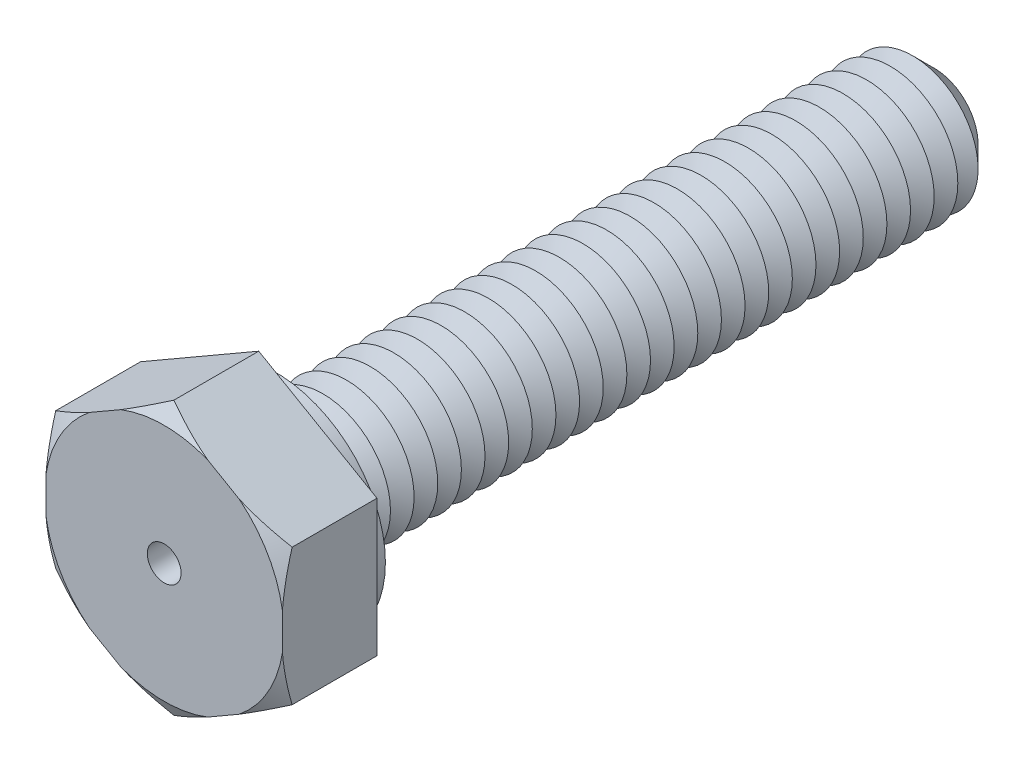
from build123d import *

# Parameters (mm, degrees)
BOSS_EXTRUDE1_DEPTH = 2.8
SKETCH3_R           = 2
BOSS_EXTRUDE2_DEPTH = 20
SKETCH4_R           = 3.25
BOSS_EXTRUDE3_DEPTH = 0.5
CHAMFER1_SIZE       = 0.7
LPATTERN1_COUNT     = 27
LPATTERN1_PITCH     = 0.7
SKETCH8_R           = 0.5
CUT_EXTRUDE1_DEPTH  = 22.8


with BuildPart() as part:
    # Sketch2 → Boss-Extrude1 (new body)
    with BuildSketch(Plane.XY):
        Polygon((0, 4.041451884), (-3.5, 2.020725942), (-3.5, -2.020725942), (0, -4.041451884), (3.5, -2.020725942), (3.5, 2.020725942), align=None)
    extrude(amount=BOSS_EXTRUDE1_DEPTH)

    # Sketch3 → Boss-Extrude2 (add)
    with BuildSketch(Plane(origin=(0, 0, 0), x_dir=(-1, 0, 0), z_dir=(0, 0, -1))):
        Circle(SKETCH3_R)
    extrude(amount=BOSS_EXTRUDE2_DEPTH)

    # Sketch4 → Boss-Extrude3 (add)
    with BuildSketch(Plane(origin=(0, 0, 0), x_dir=(-1, 0, 0), z_dir=(0, 0, -1))):
        with Locations(Location((0, 0, 0), (0, 0, 180))):
            Circle(SKETCH4_R)
    extrude(amount=BOSS_EXTRUDE3_DEPTH)

    # Chamfer1
    chamfer1_edges = [part.edges().sort_by_distance(p)[0] for p in [
        (2, 0, -20),
    ]]
    chamfer(chamfer1_edges, length=CHAMFER1_SIZE)

    # Sketch6 → Cut-Revolve1 (revolve, cut)
    with BuildSketch(Plane(origin=(0, 0, 0), x_dir=(0, 0, -1), z_dir=(1, 0, 0)), mode=Mode.PRIVATE) as cut_revolve1_sk:
        Polygon((0.5, 2), (0.85, 1.393782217), (1.2, 2), align=None)
    cut_revolve1 = revolve(cut_revolve1_sk.sketch.rotate(Axis((0, 0, 3.211670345), (0, 0, -1)), 90), axis=Axis((0, 0, 3.211670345), (0, 0, -1)), mode=Mode.SUBTRACT)

    # LPattern1: Cut-Revolve1 ×27
    with Locations(*[(0, 0, -i * LPATTERN1_PITCH) for i in range(1, LPATTERN1_COUNT)]):
        add(cut_revolve1, mode=Mode.SUBTRACT)

    # Sketch7 → Cut-Revolve2 (revolve, cut)
    with BuildSketch(Plane(origin=(0, 0, 0), x_dir=(0, 0, -1), z_dir=(1, 0, 0)), mode=Mode.PRIVATE) as cut_revolve2_sk:
        Polygon((-2.8, 4.041451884), (-2.8, 3.541451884), (-2.511324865, 4.041451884), align=None)
    revolve(cut_revolve2_sk.sketch.rotate(Axis((0, 0, 3.211670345), (0, 0, -1)), 270), axis=Axis((0, 0, 3.211670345), (0, 0, -1)), mode=Mode.SUBTRACT)

    # Sketch8 → Cut-Extrude1 (cut)
    with BuildSketch(Plane.XY.offset(2.8)):
        Circle(SKETCH8_R)
    extrude(amount=-CUT_EXTRUDE1_DEPTH, mode=Mode.SUBTRACT)


solid = part.part
